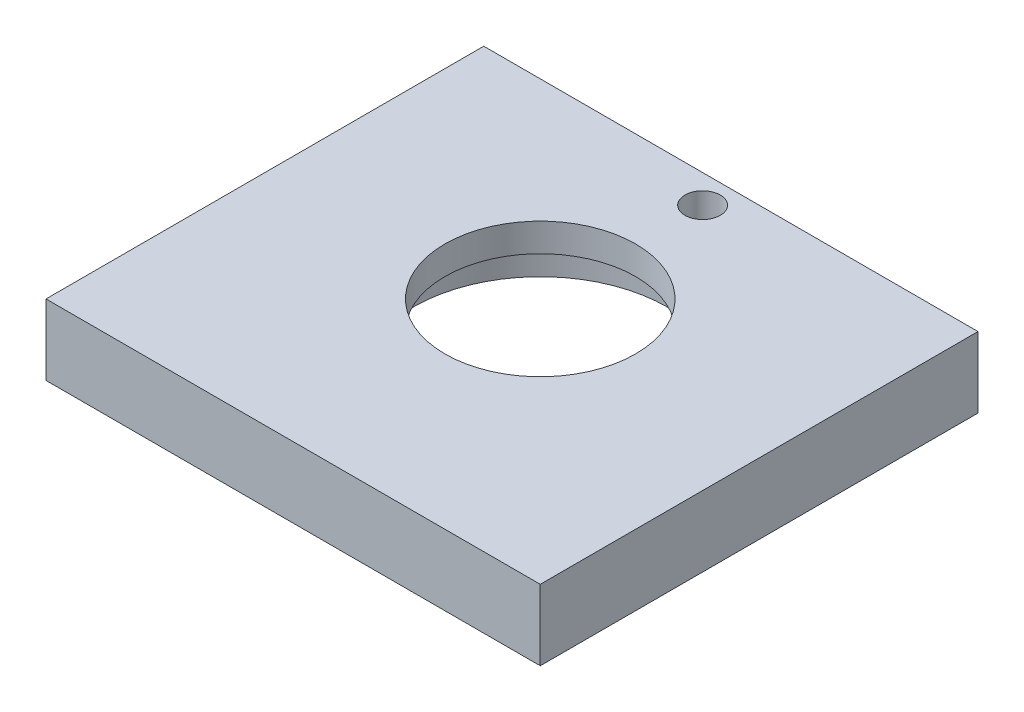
ISO-10303-21;
HEADER;
FILE_DESCRIPTION(('STEP AP214'),'2;1');
FILE_NAME('part.step','',(''),(''),'','','');
FILE_SCHEMA(('AUTOMOTIVE_DESIGN { 1 0 10303 214 1 1 1 1 }'));
ENDSEC;
DATA;
#1=APPLICATION_CONTEXT('core data for automotive mechanical design processes');
#2=APPLICATION_PROTOCOL_DEFINITION('international standard','automotive_design',2000,#1);
#3=PRODUCT_CONTEXT('',#1,'mechanical');
#4=PRODUCT('Part','Part','',(#3));
#5=PRODUCT_RELATED_PRODUCT_CATEGORY('part','',(#4));
#6=PRODUCT_DEFINITION_FORMATION('','',#4);
#7=PRODUCT_DEFINITION_CONTEXT('part definition',#1,'design');
#8=PRODUCT_DEFINITION('design','',#6,#7);
#9=PRODUCT_DEFINITION_SHAPE('','',#8);
#10=(LENGTH_UNIT() NAMED_UNIT(*) SI_UNIT(.MILLI.,.METRE.));
#11=(NAMED_UNIT(*) PLANE_ANGLE_UNIT() SI_UNIT($,.RADIAN.));
#12=(NAMED_UNIT(*) SI_UNIT($,.STERADIAN.) SOLID_ANGLE_UNIT());
#13=UNCERTAINTY_MEASURE_WITH_UNIT(LENGTH_MEASURE(1.E-05),#10,'distance_accuracy_value','');
#14=(GEOMETRIC_REPRESENTATION_CONTEXT(3) GLOBAL_UNCERTAINTY_ASSIGNED_CONTEXT((#13)) GLOBAL_UNIT_ASSIGNED_CONTEXT((#10,
#11,#12)) REPRESENTATION_CONTEXT('',''));
#15=CARTESIAN_POINT('',(0.,0.,0.));
#16=DIRECTION('',(0.,0.,1.));
#17=DIRECTION('',(1.,0.,0.));
#18=AXIS2_PLACEMENT_3D('',#15,#16,#17);
#19=CARTESIAN_POINT('',(-45.,73.,27.));
#20=DIRECTION('',(0.,1.,0.));
#21=DIRECTION('',(0.,0.,1.));
#22=AXIS2_PLACEMENT_3D('',#19,#20,#21);
#23=CYLINDRICAL_SURFACE('',#22,13.5);
#24=CARTESIAN_POINT('',(-45.,135.,27.));
#25=DIRECTION('',(0.,1.,0.));
#26=DIRECTION('',(0.,0.,1.));
#27=AXIS2_PLACEMENT_3D('',#24,#25,#26);
#28=CIRCLE('',#27,13.5);
#29=CARTESIAN_POINT('',(-45.,135.,40.5));
#30=VERTEX_POINT('',#29);
#31=EDGE_CURVE('E120',#30,#30,#28,.T.);
#32=ORIENTED_EDGE('',*,*,#31,.T.);
#33=EDGE_LOOP('',(#32));
#34=FACE_BOUND('',#33,.T.);
#35=CARTESIAN_POINT('',(-45.,131.,27.));
#36=DIRECTION('',(0.,-1.,0.));
#37=DIRECTION('',(0.,0.,-1.));
#38=AXIS2_PLACEMENT_3D('',#35,#36,#37);
#39=CIRCLE('',#38,13.5);
#40=CARTESIAN_POINT('',(-45.,131.,13.5));
#41=VERTEX_POINT('',#40);
#42=EDGE_CURVE('E40',#41,#41,#39,.F.);
#43=ORIENTED_EDGE('',*,*,#42,.F.);
#44=EDGE_LOOP('',(#43));
#45=FACE_BOUND('',#44,.T.);
#46=ADVANCED_FACE('F36',(#34,#45),#23,.F.);
#47=CARTESIAN_POINT('',(-80.,135.,62.));
#48=DIRECTION('',(1.,0.,0.));
#49=DIRECTION('',(0.,0.,-1.));
#50=AXIS2_PLACEMENT_3D('',#47,#48,#49);
#51=PLANE('',#50);
#52=DIRECTION('',(0.,-1.,0.));
#53=VECTOR('',#52,1.);
#54=CARTESIAN_POINT('',(-80.,135.,0.));
#55=LINE('',#54,#53);
#56=CARTESIAN_POINT('',(-80.,135.,0.));
#57=VERTEX_POINT('',#56);
#58=CARTESIAN_POINT('',(-80.,125.,0.));
#59=VERTEX_POINT('',#58);
#60=EDGE_CURVE('E123',#57,#59,#55,.T.);
#61=ORIENTED_EDGE('',*,*,#60,.T.);
#62=DIRECTION('',(0.,0.,-1.));
#63=VECTOR('',#62,1.);
#64=CARTESIAN_POINT('',(-80.,125.,62.));
#65=LINE('',#64,#63);
#66=CARTESIAN_POINT('',(-80.,125.,62.));
#67=VERTEX_POINT('',#66);
#68=EDGE_CURVE('E11',#67,#59,#65,.T.);
#69=ORIENTED_EDGE('',*,*,#68,.F.);
#70=DIRECTION('',(0.,-1.,0.));
#71=VECTOR('',#70,1.);
#72=CARTESIAN_POINT('',(-80.,135.,62.));
#73=LINE('',#72,#71);
#74=CARTESIAN_POINT('',(-80.,135.,62.));
#75=VERTEX_POINT('',#74);
#76=EDGE_CURVE('E124',#75,#67,#73,.T.);
#77=ORIENTED_EDGE('',*,*,#76,.F.);
#78=DIRECTION('',(0.,0.,-1.));
#79=VECTOR('',#78,1.);
#80=CARTESIAN_POINT('',(-80.,135.,62.));
#81=LINE('',#80,#79);
#82=EDGE_CURVE('E130',#75,#57,#81,.T.);
#83=ORIENTED_EDGE('',*,*,#82,.T.);
#84=EDGE_LOOP('',(#61,#69,#77,#83));
#85=FACE_BOUND('',#84,.T.);
#86=ADVANCED_FACE('F38',(#85),#51,.F.);
#87=CARTESIAN_POINT('',(-80.,125.,62.));
#88=DIRECTION('',(0.,1.,0.));
#89=DIRECTION('',(0.,0.,1.));
#90=AXIS2_PLACEMENT_3D('',#87,#88,#89);
#91=PLANE('',#90);
#92=CARTESIAN_POINT('',(-45.,125.,27.));
#93=DIRECTION('',(0.,-1.,0.));
#94=DIRECTION('',(0.,0.,-1.));
#95=AXIS2_PLACEMENT_3D('',#92,#93,#94);
#96=CIRCLE('',#95,18.);
#97=CARTESIAN_POINT('',(-45.,125.,9.00000000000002));
#98=VERTEX_POINT('',#97);
#99=EDGE_CURVE('E210',#98,#98,#96,.T.);
#100=ORIENTED_EDGE('',*,*,#99,.F.);
#101=EDGE_LOOP('',(#100));
#102=FACE_BOUND('',#101,.T.);
#103=CARTESIAN_POINT('',(-45.,125.,4.00000000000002));
#104=DIRECTION('',(0.,1.,0.));
#105=DIRECTION('',(0.,0.,1.));
#106=AXIS2_PLACEMENT_3D('',#103,#104,#105);
#107=CIRCLE('',#106,2.5);
#108=CARTESIAN_POINT('',(-45.,125.,6.50000000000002));
#109=VERTEX_POINT('',#108);
#110=EDGE_CURVE('E117',#109,#109,#107,.T.);
#111=ORIENTED_EDGE('',*,*,#110,.T.);
#112=EDGE_LOOP('',(#111));
#113=FACE_BOUND('',#112,.T.);
#114=DIRECTION('',(1.,0.,0.));
#115=VECTOR('',#114,1.);
#116=CARTESIAN_POINT('',(-80.,125.,0.));
#117=LINE('',#116,#115);
#118=CARTESIAN_POINT('',(-10.,125.,0.));
#119=VERTEX_POINT('',#118);
#120=EDGE_CURVE('E133',#59,#119,#117,.T.);
#121=ORIENTED_EDGE('',*,*,#120,.T.);
#122=DIRECTION('',(0.,0.,-1.));
#123=VECTOR('',#122,1.);
#124=CARTESIAN_POINT('',(-10.,125.,62.));
#125=LINE('',#124,#123);
#126=CARTESIAN_POINT('',(-10.,125.,62.));
#127=VERTEX_POINT('',#126);
#128=EDGE_CURVE('E46',#127,#119,#125,.T.);
#129=ORIENTED_EDGE('',*,*,#128,.F.);
#130=DIRECTION('',(1.,0.,0.));
#131=VECTOR('',#130,1.);
#132=CARTESIAN_POINT('',(-80.,125.,62.));
#133=LINE('',#132,#131);
#134=EDGE_CURVE('E85',#67,#127,#133,.T.);
#135=ORIENTED_EDGE('',*,*,#134,.F.);
#136=ORIENTED_EDGE('',*,*,#68,.T.);
#137=EDGE_LOOP('',(#121,#129,#135,#136));
#138=FACE_BOUND('',#137,.T.);
#139=ADVANCED_FACE('F158',(#102,#113,#138),#91,.F.);
#140=CARTESIAN_POINT('',(-10.,135.,62.));
#141=DIRECTION('',(-1.,0.,0.));
#142=DIRECTION('',(0.,0.,1.));
#143=AXIS2_PLACEMENT_3D('',#140,#141,#142);
#144=PLANE('',#143);
#145=DIRECTION('',(0.,1.,0.));
#146=VECTOR('',#145,1.);
#147=CARTESIAN_POINT('',(-10.,135.,0.));
#148=LINE('',#147,#146);
#149=CARTESIAN_POINT('',(-10.,135.,0.));
#150=VERTEX_POINT('',#149);
#151=EDGE_CURVE('E72',#119,#150,#148,.T.);
#152=ORIENTED_EDGE('',*,*,#151,.T.);
#153=DIRECTION('',(0.,0.,-1.));
#154=VECTOR('',#153,1.);
#155=CARTESIAN_POINT('',(-10.,135.,62.));
#156=LINE('',#155,#154);
#157=CARTESIAN_POINT('',(-10.,135.,62.));
#158=VERTEX_POINT('',#157);
#159=EDGE_CURVE('E138',#158,#150,#156,.T.);
#160=ORIENTED_EDGE('',*,*,#159,.F.);
#161=DIRECTION('',(0.,1.,0.));
#162=VECTOR('',#161,1.);
#163=CARTESIAN_POINT('',(-10.,135.,62.));
#164=LINE('',#163,#162);
#165=EDGE_CURVE('E127',#127,#158,#164,.T.);
#166=ORIENTED_EDGE('',*,*,#165,.F.);
#167=ORIENTED_EDGE('',*,*,#128,.T.);
#168=EDGE_LOOP('',(#152,#160,#166,#167));
#169=FACE_BOUND('',#168,.T.);
#170=ADVANCED_FACE('F141',(#169),#144,.F.);
#171=CARTESIAN_POINT('',(-80.,135.,62.));
#172=DIRECTION('',(0.,-1.,0.));
#173=DIRECTION('',(0.,0.,-1.));
#174=AXIS2_PLACEMENT_3D('',#171,#172,#173);
#175=PLANE('',#174);
#176=CARTESIAN_POINT('',(-45.,135.,4.00000000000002));
#177=DIRECTION('',(0.,1.,0.));
#178=DIRECTION('',(0.,0.,1.));
#179=AXIS2_PLACEMENT_3D('',#176,#177,#178);
#180=CIRCLE('',#179,2.5);
#181=CARTESIAN_POINT('',(-45.,135.,6.50000000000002));
#182=VERTEX_POINT('',#181);
#183=EDGE_CURVE('E114',#182,#182,#180,.T.);
#184=ORIENTED_EDGE('',*,*,#183,.F.);
#185=EDGE_LOOP('',(#184));
#186=FACE_BOUND('',#185,.T.);
#187=ORIENTED_EDGE('',*,*,#31,.F.);
#188=EDGE_LOOP('',(#187));
#189=FACE_BOUND('',#188,.T.);
#190=DIRECTION('',(-1.,0.,0.));
#191=VECTOR('',#190,1.);
#192=CARTESIAN_POINT('',(-80.,135.,0.));
#193=LINE('',#192,#191);
#194=EDGE_CURVE('E78',#150,#57,#193,.T.);
#195=ORIENTED_EDGE('',*,*,#194,.T.);
#196=ORIENTED_EDGE('',*,*,#82,.F.);
#197=DIRECTION('',(-1.,0.,0.));
#198=VECTOR('',#197,1.);
#199=CARTESIAN_POINT('',(-80.,135.,62.));
#200=LINE('',#199,#198);
#201=EDGE_CURVE('E54',#158,#75,#200,.T.);
#202=ORIENTED_EDGE('',*,*,#201,.F.);
#203=ORIENTED_EDGE('',*,*,#159,.T.);
#204=EDGE_LOOP('',(#195,#196,#202,#203));
#205=FACE_BOUND('',#204,.T.);
#206=ADVANCED_FACE('F148',(#186,#189,#205),#175,.F.);
#207=CARTESIAN_POINT('',(0.,0.,62.));
#208=DIRECTION('',(0.,0.,1.));
#209=DIRECTION('',(1.,0.,0.));
#210=AXIS2_PLACEMENT_3D('',#207,#208,#209);
#211=PLANE('',#210);
#212=ORIENTED_EDGE('',*,*,#76,.T.);
#213=ORIENTED_EDGE('',*,*,#134,.T.);
#214=ORIENTED_EDGE('',*,*,#165,.T.);
#215=ORIENTED_EDGE('',*,*,#201,.T.);
#216=EDGE_LOOP('',(#212,#213,#214,#215));
#217=FACE_BOUND('',#216,.T.);
#218=ADVANCED_FACE('F150',(#217),#211,.T.);
#219=CARTESIAN_POINT('',(0.,0.,0.));
#220=DIRECTION('',(0.,0.,1.));
#221=DIRECTION('',(1.,0.,0.));
#222=AXIS2_PLACEMENT_3D('',#219,#220,#221);
#223=PLANE('',#222);
#224=CARTESIAN_POINT('',(-20.,130.,0.));
#225=DIRECTION('',(0.,0.,-1.));
#226=DIRECTION('',(-1.,0.,0.));
#227=AXIS2_PLACEMENT_3D('',#224,#225,#226);
#228=CIRCLE('',#227,2.09999999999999);
#229=CARTESIAN_POINT('',(-22.1,130.,0.));
#230=VERTEX_POINT('',#229);
#231=EDGE_CURVE('E103',#230,#230,#228,.T.);
#232=ORIENTED_EDGE('',*,*,#231,.F.);
#233=EDGE_LOOP('',(#232));
#234=FACE_BOUND('',#233,.T.);
#235=CARTESIAN_POINT('',(-70.,130.,0.));
#236=DIRECTION('',(0.,0.,-1.));
#237=DIRECTION('',(-1.,0.,0.));
#238=AXIS2_PLACEMENT_3D('',#235,#236,#237);
#239=CIRCLE('',#238,2.09999999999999);
#240=CARTESIAN_POINT('',(-72.1,130.,0.));
#241=VERTEX_POINT('',#240);
#242=EDGE_CURVE('E102',#241,#241,#239,.T.);
#243=ORIENTED_EDGE('',*,*,#242,.F.);
#244=EDGE_LOOP('',(#243));
#245=FACE_BOUND('',#244,.T.);
#246=ORIENTED_EDGE('',*,*,#60,.F.);
#247=ORIENTED_EDGE('',*,*,#194,.F.);
#248=ORIENTED_EDGE('',*,*,#151,.F.);
#249=ORIENTED_EDGE('',*,*,#120,.F.);
#250=EDGE_LOOP('',(#246,#247,#248,#249));
#251=FACE_BOUND('',#250,.T.);
#252=ADVANCED_FACE('F144',(#234,#245,#251),#223,.F.);
#253=CARTESIAN_POINT('',(-45.,73.,4.00000000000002));
#254=DIRECTION('',(0.,1.,0.));
#255=DIRECTION('',(0.,0.,1.));
#256=AXIS2_PLACEMENT_3D('',#253,#254,#255);
#257=CYLINDRICAL_SURFACE('',#256,2.5);
#258=ORIENTED_EDGE('',*,*,#183,.T.);
#259=EDGE_LOOP('',(#258));
#260=FACE_BOUND('',#259,.T.);
#261=ORIENTED_EDGE('',*,*,#110,.F.);
#262=EDGE_LOOP('',(#261));
#263=FACE_BOUND('',#262,.T.);
#264=ADVANCED_FACE('F171',(#260,#263),#257,.F.);
#265=CARTESIAN_POINT('',(-70.,130.,15.));
#266=DIRECTION('',(0.,0.,-1.));
#267=DIRECTION('',(-1.,0.,0.));
#268=AXIS2_PLACEMENT_3D('',#265,#266,#267);
#269=CONICAL_SURFACE('',#268,2.09999999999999,1.02974425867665);
#270=CARTESIAN_POINT('',(-70.,130.,16.2618072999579));
#271=VERTEX_POINT('',#270);
#272=VERTEX_LOOP('',#271);
#273=FACE_BOUND('',#272,.T.);
#274=CARTESIAN_POINT('',(-70.,130.,15.));
#275=DIRECTION('',(0.,0.,-1.));
#276=DIRECTION('',(-1.,0.,0.));
#277=AXIS2_PLACEMENT_3D('',#274,#275,#276);
#278=CIRCLE('',#277,2.09999999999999);
#279=CARTESIAN_POINT('',(-72.1,130.,15.));
#280=VERTEX_POINT('',#279);
#281=EDGE_CURVE('E106',#280,#280,#278,.T.);
#282=ORIENTED_EDGE('',*,*,#281,.T.);
#283=EDGE_LOOP('',(#282));
#284=FACE_BOUND('',#283,.T.);
#285=ADVANCED_FACE('F178',(#273,#284),#269,.F.);
#286=CARTESIAN_POINT('',(-70.,130.,0.));
#287=DIRECTION('',(0.,0.,-1.));
#288=DIRECTION('',(-1.,0.,0.));
#289=AXIS2_PLACEMENT_3D('',#286,#287,#288);
#290=CYLINDRICAL_SURFACE('',#289,2.09999999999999);
#291=ORIENTED_EDGE('',*,*,#281,.F.);
#292=EDGE_LOOP('',(#291));
#293=FACE_BOUND('',#292,.T.);
#294=ORIENTED_EDGE('',*,*,#242,.T.);
#295=EDGE_LOOP('',(#294));
#296=FACE_BOUND('',#295,.T.);
#297=ADVANCED_FACE('F96',(#293,#296),#290,.F.);
#298=CARTESIAN_POINT('',(-20.,130.,15.));
#299=DIRECTION('',(0.,0.,-1.));
#300=DIRECTION('',(-1.,0.,0.));
#301=AXIS2_PLACEMENT_3D('',#298,#299,#300);
#302=CONICAL_SURFACE('',#301,2.09999999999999,1.02974425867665);
#303=CARTESIAN_POINT('',(-20.,130.,16.2618072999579));
#304=VERTEX_POINT('',#303);
#305=VERTEX_LOOP('',#304);
#306=FACE_BOUND('',#305,.T.);
#307=CARTESIAN_POINT('',(-20.,130.,15.));
#308=DIRECTION('',(0.,0.,-1.));
#309=DIRECTION('',(-1.,0.,0.));
#310=AXIS2_PLACEMENT_3D('',#307,#308,#309);
#311=CIRCLE('',#310,2.09999999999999);
#312=CARTESIAN_POINT('',(-22.1,130.,15.));
#313=VERTEX_POINT('',#312);
#314=EDGE_CURVE('E100',#313,#313,#311,.T.);
#315=ORIENTED_EDGE('',*,*,#314,.T.);
#316=EDGE_LOOP('',(#315));
#317=FACE_BOUND('',#316,.T.);
#318=ADVANCED_FACE('F92',(#306,#317),#302,.F.);
#319=CARTESIAN_POINT('',(-20.,130.,0.));
#320=DIRECTION('',(0.,0.,-1.));
#321=DIRECTION('',(-1.,0.,0.));
#322=AXIS2_PLACEMENT_3D('',#319,#320,#321);
#323=CYLINDRICAL_SURFACE('',#322,2.09999999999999);
#324=ORIENTED_EDGE('',*,*,#314,.F.);
#325=EDGE_LOOP('',(#324));
#326=FACE_BOUND('',#325,.T.);
#327=ORIENTED_EDGE('',*,*,#231,.T.);
#328=EDGE_LOOP('',(#327));
#329=FACE_BOUND('',#328,.T.);
#330=ADVANCED_FACE('F95',(#326,#329),#323,.F.);
#331=CARTESIAN_POINT('',(-45.,131.,27.));
#332=DIRECTION('',(0.,-1.,0.));
#333=DIRECTION('',(0.,0.,-1.));
#334=AXIS2_PLACEMENT_3D('',#331,#332,#333);
#335=PLANE('',#334);
#336=CARTESIAN_POINT('',(-45.,131.,27.));
#337=DIRECTION('',(0.,-1.,0.));
#338=DIRECTION('',(0.,0.,-1.));
#339=AXIS2_PLACEMENT_3D('',#336,#337,#338);
#340=CIRCLE('',#339,18.);
#341=CARTESIAN_POINT('',(-45.,131.,9.00000000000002));
#342=VERTEX_POINT('',#341);
#343=EDGE_CURVE('E207',#342,#342,#340,.T.);
#344=ORIENTED_EDGE('',*,*,#343,.T.);
#345=EDGE_LOOP('',(#344));
#346=FACE_BOUND('',#345,.T.);
#347=ORIENTED_EDGE('',*,*,#42,.T.);
#348=EDGE_LOOP('',(#347));
#349=FACE_BOUND('',#348,.T.);
#350=ADVANCED_FACE('F195',(#346,#349),#335,.T.);
#351=CARTESIAN_POINT('',(-45.,131.,27.));
#352=DIRECTION('',(0.,-1.,0.));
#353=DIRECTION('',(0.,0.,-1.));
#354=AXIS2_PLACEMENT_3D('',#351,#352,#353);
#355=CYLINDRICAL_SURFACE('',#354,18.);
#356=ORIENTED_EDGE('',*,*,#343,.F.);
#357=EDGE_LOOP('',(#356));
#358=FACE_BOUND('',#357,.T.);
#359=ORIENTED_EDGE('',*,*,#99,.T.);
#360=EDGE_LOOP('',(#359));
#361=FACE_BOUND('',#360,.T.);
#362=ADVANCED_FACE('F196',(#358,#361),#355,.F.);
#363=CLOSED_SHELL('',(#46,#86,#139,#170,#206,#218,#252,#264,#285,#297,#318,#330,#350,#362));
#364=MANIFOLD_SOLID_BREP('B2',#363);
#365=ADVANCED_BREP_SHAPE_REPRESENTATION('',(#18,#364),#14);
#366=SHAPE_DEFINITION_REPRESENTATION(#9,#365);
ENDSEC;
END-ISO-10303-21;
